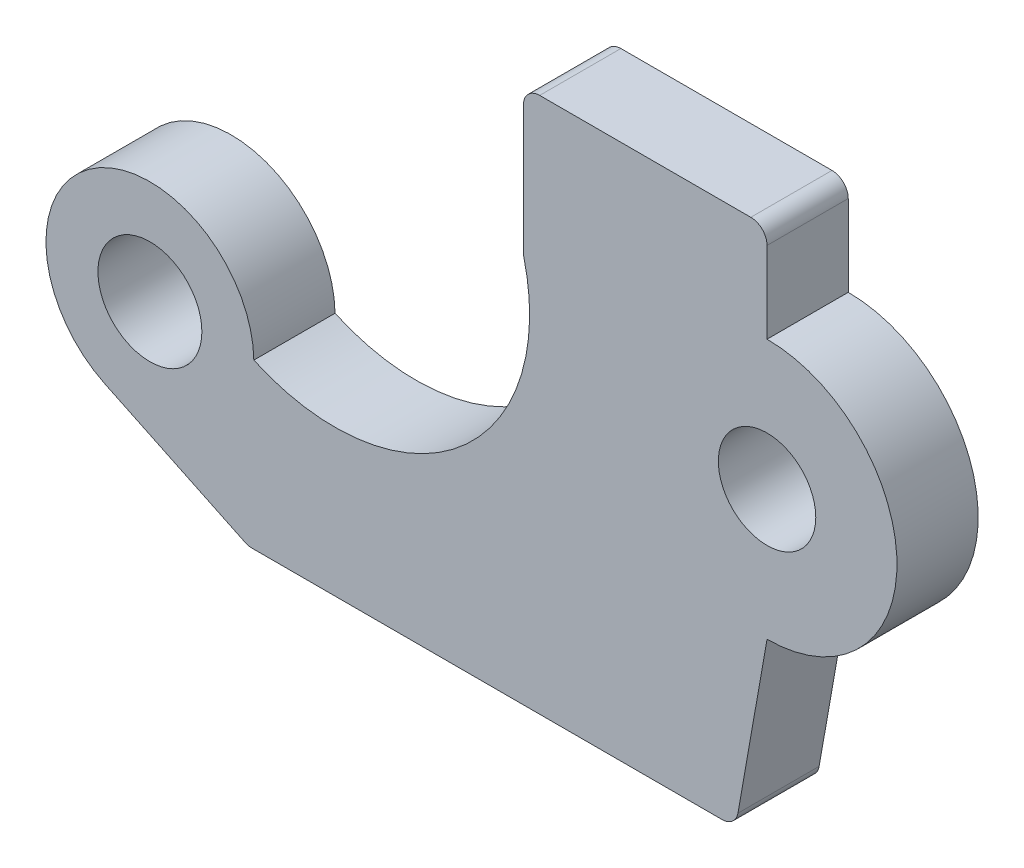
from build123d import *

# Parameters (mm, degrees)
ESQUISSE1_R        = 1.5
ESQUISSE1_R_2      = 1.6
BOSS_EXTRU_1_DEPTH = 2.5
CONG_1_R           = 0.5


with BuildPart() as part:
    # Esquisse1 → Boss.-Extru.1 (new body)
    with BuildSketch(Plane.XY):
        with BuildLine():
            Line((0, 4), (0, 7))
            Line((0, 7), (-7.5, 7))
            Line((-7.5, 7), (-7.5, 2.5))
            ThreePointArc((-7.5, 2.5), (-9.454760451, -3.597953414), (-15.80026825, -4.458566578))
            ThreePointArc((-15.80026825, -4.458566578), (-20.722738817, -1.803303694), (-20.382589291, -7.385904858))
            Line((-20.382589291, -7.385904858), (-15.969798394, -9.5))
            Line((-15.969798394, -9.5), (-0.969798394, -9.5))
            Line((-0.969798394, -9.5), (0, -4))
            ThreePointArc((0, -4), (4, 0), (0, 4))
        make_face()
        Circle(ESQUISSE1_R, mode=Mode.SUBTRACT)
        with Locations((-19, -4.5)):
            Circle(ESQUISSE1_R_2, mode=Mode.SUBTRACT)
    extrude(amount=BOSS_EXTRU_1_DEPTH)

    # Cong_1
    cong_1_edges = [part.edges().sort_by_distance(p)[0] for p in [
        (-0.969798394, -9.5, 1.25),
        (-15.969798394, -9.5, 1.25),
        (-7.5, 7, 1.25),
        (0, 7, 1.25),
    ]]
    fillet(cong_1_edges, radius=CONG_1_R)


solid = part.part
